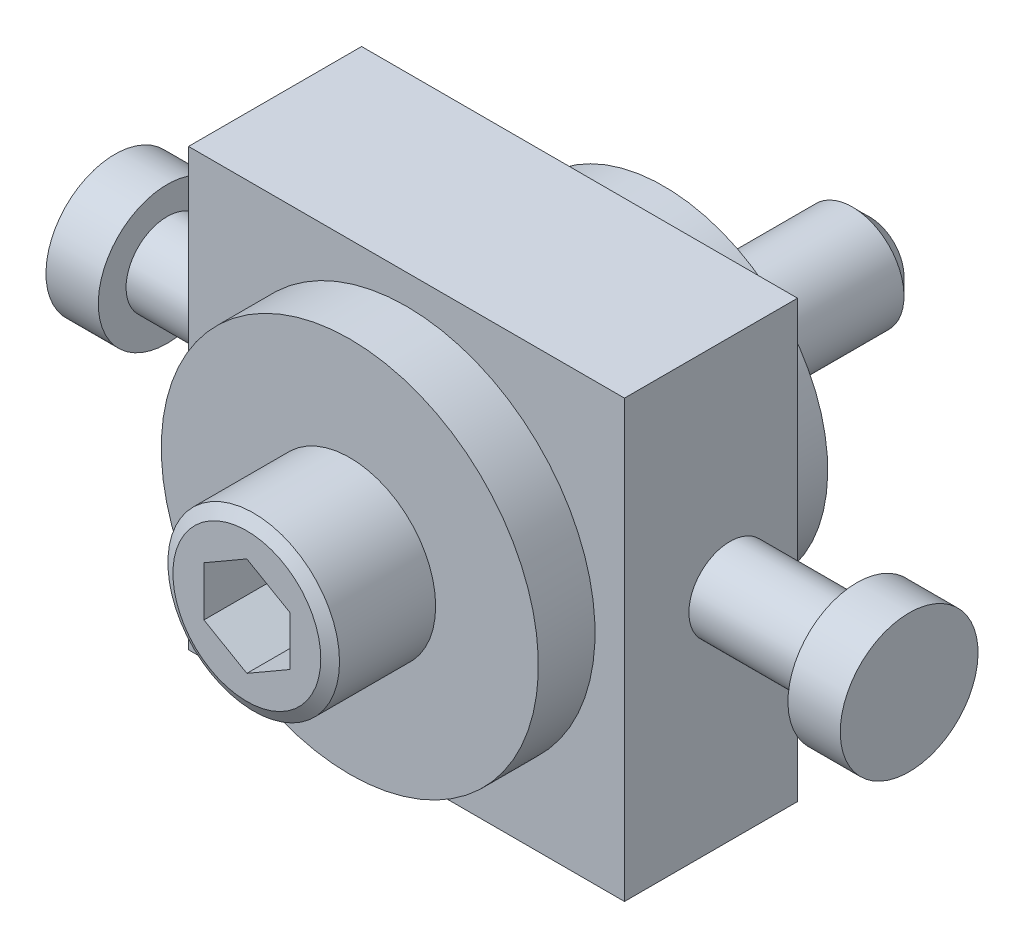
ISO-10303-21;
HEADER;
FILE_DESCRIPTION(('STEP AP214'),'2;1');
FILE_NAME('part.step','',(''),(''),'','','');
FILE_SCHEMA(('AUTOMOTIVE_DESIGN { 1 0 10303 214 1 1 1 1 }'));
ENDSEC;
DATA;
#1=APPLICATION_CONTEXT('core data for automotive mechanical design processes');
#2=APPLICATION_PROTOCOL_DEFINITION('international standard','automotive_design',2000,#1);
#3=PRODUCT_CONTEXT('',#1,'mechanical');
#4=PRODUCT('Part','Part','',(#3));
#5=PRODUCT_RELATED_PRODUCT_CATEGORY('part','',(#4));
#6=PRODUCT_DEFINITION_FORMATION('','',#4);
#7=PRODUCT_DEFINITION_CONTEXT('part definition',#1,'design');
#8=PRODUCT_DEFINITION('design','',#6,#7);
#9=PRODUCT_DEFINITION_SHAPE('','',#8);
#10=(LENGTH_UNIT() NAMED_UNIT(*) SI_UNIT(.MILLI.,.METRE.));
#11=(NAMED_UNIT(*) PLANE_ANGLE_UNIT() SI_UNIT($,.RADIAN.));
#12=(NAMED_UNIT(*) SI_UNIT($,.STERADIAN.) SOLID_ANGLE_UNIT());
#13=UNCERTAINTY_MEASURE_WITH_UNIT(LENGTH_MEASURE(1.E-05),#10,'distance_accuracy_value','');
#14=(GEOMETRIC_REPRESENTATION_CONTEXT(3) GLOBAL_UNCERTAINTY_ASSIGNED_CONTEXT((#13)) GLOBAL_UNIT_ASSIGNED_CONTEXT((#10,
#11,#12)) REPRESENTATION_CONTEXT('',''));
#15=CARTESIAN_POINT('',(0.,0.,0.));
#16=DIRECTION('',(0.,0.,1.));
#17=DIRECTION('',(1.,0.,0.));
#18=AXIS2_PLACEMENT_3D('',#15,#16,#17);
#19=CARTESIAN_POINT('',(20.0914,-4.0613584,4.7778416));
#20=DIRECTION('',(1.,0.,0.));
#21=DIRECTION('',(0.,1.,0.));
#22=AXIS2_PLACEMENT_3D('',#19,#20,#21);
#23=PLANE('',#22);
#24=CARTESIAN_POINT('',(20.0914,0.,8.8392));
#25=DIRECTION('',(1.,0.,0.));
#26=DIRECTION('',(0.,1.,0.));
#27=AXIS2_PLACEMENT_3D('',#24,#25,#26);
#28=CIRCLE('',#27,4.0132);
#29=CARTESIAN_POINT('',(20.0914,4.0132,8.8392));
#30=VERTEX_POINT('',#29);
#31=EDGE_CURVE('E203',#30,#30,#28,.F.);
#32=ORIENTED_EDGE('',*,*,#31,.T.);
#33=EDGE_LOOP('',(#32));
#34=FACE_BOUND('',#33,.T.);
#35=CARTESIAN_POINT('',(20.0914,0.,8.8392));
#36=DIRECTION('',(-1.,0.,0.));
#37=DIRECTION('',(0.,-1.,0.));
#38=AXIS2_PLACEMENT_3D('',#35,#36,#37);
#39=CIRCLE('',#38,2.39395000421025);
#40=CARTESIAN_POINT('',(20.0914,-2.39395000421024,8.8392));
#41=VERTEX_POINT('',#40);
#42=EDGE_CURVE('E96',#41,#41,#39,.T.);
#43=ORIENTED_EDGE('',*,*,#42,.F.);
#44=EDGE_LOOP('',(#43));
#45=FACE_BOUND('',#44,.T.);
#46=ADVANCED_FACE('F14',(#34,#45),#23,.F.);
#47=CARTESIAN_POINT('',(-20.0914,5.567775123,7.4288297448));
#48=DIRECTION('',(-1.,0.,0.));
#49=DIRECTION('',(0.,-0.859090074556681,-0.511824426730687));
#50=AXIS2_PLACEMENT_3D('',#47,#48,#49);
#51=PLANE('',#50);
#52=CARTESIAN_POINT('',(-20.0914,0.,8.8392));
#53=DIRECTION('',(-1.,0.,0.));
#54=DIRECTION('',(0.,-1.,0.));
#55=AXIS2_PLACEMENT_3D('',#52,#53,#54);
#56=CIRCLE('',#55,4.01319999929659);
#57=CARTESIAN_POINT('',(-20.0914,-4.01319999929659,8.8392));
#58=VERTEX_POINT('',#57);
#59=EDGE_CURVE('E200',#58,#58,#56,.F.);
#60=ORIENTED_EDGE('',*,*,#59,.T.);
#61=EDGE_LOOP('',(#60));
#62=FACE_BOUND('',#61,.T.);
#63=CARTESIAN_POINT('',(-20.0914,0.,8.8392));
#64=DIRECTION('',(1.,0.,0.));
#65=DIRECTION('',(0.,1.,0.));
#66=AXIS2_PLACEMENT_3D('',#63,#64,#65);
#67=CIRCLE('',#66,2.3939500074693);
#68=CARTESIAN_POINT('',(-20.0914,2.3939500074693,8.8392));
#69=VERTEX_POINT('',#68);
#70=EDGE_CURVE('E101',#69,#69,#67,.T.);
#71=ORIENTED_EDGE('',*,*,#70,.F.);
#72=EDGE_LOOP('',(#71));
#73=FACE_BOUND('',#72,.T.);
#74=ADVANCED_FACE('F125',(#62,#73),#51,.F.);
#75=CARTESIAN_POINT('',(0.,0.,-11.1575000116));
#76=DIRECTION('',(0.,0.,1.));
#77=DIRECTION('',(1.,0.,0.));
#78=AXIS2_PLACEMENT_3D('',#75,#76,#77);
#79=CYLINDRICAL_SURFACE('',#78,3.0000000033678);
#80=CARTESIAN_POINT('',(0.,0.,-11.));
#81=DIRECTION('',(0.,0.,-1.));
#82=DIRECTION('',(-1.,0.,0.));
#83=AXIS2_PLACEMENT_3D('',#80,#81,#82);
#84=CIRCLE('',#83,3.0000000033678);
#85=CARTESIAN_POINT('',(-3.0000000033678,0.,-11.));
#86=VERTEX_POINT('',#85);
#87=EDGE_CURVE('E9',#86,#86,#84,.F.);
#88=ORIENTED_EDGE('',*,*,#87,.T.);
#89=EDGE_LOOP('',(#88));
#90=FACE_BOUND('',#89,.T.);
#91=CARTESIAN_POINT('',(0.,0.,0.));
#92=DIRECTION('',(0.,0.,-1.));
#93=DIRECTION('',(0.,-1.,0.));
#94=AXIS2_PLACEMENT_3D('',#91,#92,#93);
#95=CIRCLE('',#94,3.0000000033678);
#96=CARTESIAN_POINT('',(0.,-3.0000000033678,0.));
#97=VERTEX_POINT('',#96);
#98=EDGE_CURVE('E107',#97,#97,#95,.T.);
#99=ORIENTED_EDGE('',*,*,#98,.T.);
#100=EDGE_LOOP('',(#99));
#101=FACE_BOUND('',#100,.T.);
#102=ADVANCED_FACE('F131',(#90,#101),#79,.T.);
#103=CARTESIAN_POINT('',(0.,0.,18.288));
#104=DIRECTION('',(0.,0.,1.));
#105=DIRECTION('',(1.,0.,0.));
#106=AXIS2_PLACEMENT_3D('',#103,#104,#105);
#107=CYLINDRICAL_SURFACE('',#106,4.99999999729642);
#108=CARTESIAN_POINT('',(0.,0.,23.8879999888));
#109=DIRECTION('',(0.,0.,1.));
#110=DIRECTION('',(1.,0.,0.));
#111=AXIS2_PLACEMENT_3D('',#108,#109,#110);
#112=CIRCLE('',#111,4.99999999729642);
#113=CARTESIAN_POINT('',(4.99999999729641,0.,23.8879999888));
#114=VERTEX_POINT('',#113);
#115=EDGE_CURVE('E103',#114,#114,#112,.F.);
#116=ORIENTED_EDGE('',*,*,#115,.T.);
#117=EDGE_LOOP('',(#116));
#118=FACE_BOUND('',#117,.T.);
#119=CARTESIAN_POINT('',(0.,0.,18.288));
#120=DIRECTION('',(0.,0.,1.));
#121=DIRECTION('',(1.,0.,0.));
#122=AXIS2_PLACEMENT_3D('',#119,#120,#121);
#123=CIRCLE('',#122,4.99999999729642);
#124=CARTESIAN_POINT('',(4.99999999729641,0.,18.288));
#125=VERTEX_POINT('',#124);
#126=EDGE_CURVE('E187',#125,#125,#123,.F.);
#127=ORIENTED_EDGE('',*,*,#126,.F.);
#128=EDGE_LOOP('',(#127));
#129=FACE_BOUND('',#128,.T.);
#130=ADVANCED_FACE('F179',(#118,#129),#107,.T.);
#131=CARTESIAN_POINT('',(9.3629734,9.3629734,0.));
#132=DIRECTION('',(0.,0.,-1.));
#133=DIRECTION('',(0.,-1.,0.));
#134=AXIS2_PLACEMENT_3D('',#131,#132,#133);
#135=PLANE('',#134);
#136=CARTESIAN_POINT('',(0.,0.,0.));
#137=DIRECTION('',(0.,0.,-1.));
#138=DIRECTION('',(0.,-1.,0.));
#139=AXIS2_PLACEMENT_3D('',#136,#137,#138);
#140=CIRCLE('',#139,9.55675);
#141=CARTESIAN_POINT('',(0.,-9.55675,0.));
#142=VERTEX_POINT('',#141);
#143=EDGE_CURVE('E106',#142,#142,#140,.T.);
#144=ORIENTED_EDGE('',*,*,#143,.T.);
#145=EDGE_LOOP('',(#144));
#146=FACE_BOUND('',#145,.T.);
#147=ORIENTED_EDGE('',*,*,#98,.F.);
#148=EDGE_LOOP('',(#147));
#149=FACE_BOUND('',#148,.T.);
#150=ADVANCED_FACE('F182',(#146,#149),#135,.T.);
#151=CARTESIAN_POINT('',(8.5071319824,4.092723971,18.288));
#152=DIRECTION('',(0.,0.,1.));
#153=DIRECTION('',(0.,1.,0.));
#154=AXIS2_PLACEMENT_3D('',#151,#152,#153);
#155=PLANE('',#154);
#156=ORIENTED_EDGE('',*,*,#126,.T.);
#157=EDGE_LOOP('',(#156));
#158=FACE_BOUND('',#157,.T.);
#159=CARTESIAN_POINT('',(0.,0.,18.288));
#160=DIRECTION('',(0.,0.,1.));
#161=DIRECTION('',(0.,1.,0.));
#162=AXIS2_PLACEMENT_3D('',#159,#160,#161);
#163=CIRCLE('',#162,10.9855);
#164=CARTESIAN_POINT('',(0.,10.9855,18.288));
#165=VERTEX_POINT('',#164);
#166=EDGE_CURVE('E189',#165,#165,#163,.T.);
#167=ORIENTED_EDGE('',*,*,#166,.T.);
#168=EDGE_LOOP('',(#167));
#169=FACE_BOUND('',#168,.T.);
#170=ADVANCED_FACE('F184',(#158,#169),#155,.T.);
#171=CARTESIAN_POINT('',(0.,0.,4.2164));
#172=DIRECTION('',(0.,0.,-1.));
#173=DIRECTION('',(0.,-1.,0.));
#174=AXIS2_PLACEMENT_3D('',#171,#172,#173);
#175=CYLINDRICAL_SURFACE('',#174,9.55675);
#176=ORIENTED_EDGE('',*,*,#143,.F.);
#177=EDGE_LOOP('',(#176));
#178=FACE_BOUND('',#177,.T.);
#179=CARTESIAN_POINT('',(0.,0.,4.9022));
#180=DIRECTION('',(0.,0.,-1.));
#181=DIRECTION('',(0.,-1.,0.));
#182=AXIS2_PLACEMENT_3D('',#179,#180,#181);
#183=CIRCLE('',#182,9.55675);
#184=CARTESIAN_POINT('',(0.,-9.55675,4.9022));
#185=VERTEX_POINT('',#184);
#186=EDGE_CURVE('E192',#185,#185,#183,.T.);
#187=ORIENTED_EDGE('',*,*,#186,.T.);
#188=EDGE_LOOP('',(#187));
#189=FACE_BOUND('',#188,.T.);
#190=ADVANCED_FACE('F235',(#178,#189),#175,.T.);
#191=CARTESIAN_POINT('',(0.,0.,17.526));
#192=DIRECTION('',(0.,0.,-1.));
#193=DIRECTION('',(-1.,0.,0.));
#194=AXIS2_PLACEMENT_3D('',#191,#192,#193);
#195=CYLINDRICAL_SURFACE('',#194,10.9855);
#196=ORIENTED_EDGE('',*,*,#166,.F.);
#197=EDGE_LOOP('',(#196));
#198=FACE_BOUND('',#197,.T.);
#199=CARTESIAN_POINT('',(0.,0.,14.986));
#200=DIRECTION('',(0.,0.,1.));
#201=DIRECTION('',(0.,1.,0.));
#202=AXIS2_PLACEMENT_3D('',#199,#200,#201);
#203=CIRCLE('',#202,10.9855);
#204=CARTESIAN_POINT('',(0.,10.9855,14.986));
#205=VERTEX_POINT('',#204);
#206=EDGE_CURVE('E209',#205,#205,#203,.T.);
#207=ORIENTED_EDGE('',*,*,#206,.T.);
#208=EDGE_LOOP('',(#207));
#209=FACE_BOUND('',#208,.T.);
#210=ADVANCED_FACE('F161',(#198,#209),#195,.T.);
#211=CARTESIAN_POINT('',(12.7,12.7,4.9022));
#212=DIRECTION('',(0.,0.,-1.));
#213=DIRECTION('',(0.,-1.,0.));
#214=AXIS2_PLACEMENT_3D('',#211,#212,#213);
#215=PLANE('',#214);
#216=DIRECTION('',(0.,1.,0.));
#217=VECTOR('',#216,1.);
#218=CARTESIAN_POINT('',(-12.7,0.,4.9022));
#219=LINE('',#218,#217);
#220=CARTESIAN_POINT('',(-12.7,-12.7,4.9022));
#221=VERTEX_POINT('',#220);
#222=CARTESIAN_POINT('',(-12.7,12.7,4.9022));
#223=VERTEX_POINT('',#222);
#224=EDGE_CURVE('E205',#221,#223,#219,.T.);
#225=ORIENTED_EDGE('',*,*,#224,.T.);
#226=DIRECTION('',(1.,0.,0.));
#227=VECTOR('',#226,1.);
#228=CARTESIAN_POINT('',(0.,12.7,4.9022));
#229=LINE('',#228,#227);
#230=CARTESIAN_POINT('',(12.7,12.7,4.9022));
#231=VERTEX_POINT('',#230);
#232=EDGE_CURVE('E208',#223,#231,#229,.T.);
#233=ORIENTED_EDGE('',*,*,#232,.T.);
#234=DIRECTION('',(0.,-1.,0.));
#235=VECTOR('',#234,1.);
#236=CARTESIAN_POINT('',(12.7,0.,4.9022));
#237=LINE('',#236,#235);
#238=CARTESIAN_POINT('',(12.7,-12.7,4.9022));
#239=VERTEX_POINT('',#238);
#240=EDGE_CURVE('E71',#231,#239,#237,.T.);
#241=ORIENTED_EDGE('',*,*,#240,.T.);
#242=DIRECTION('',(-1.,0.,0.));
#243=VECTOR('',#242,1.);
#244=CARTESIAN_POINT('',(0.,-12.7,4.9022));
#245=LINE('',#244,#243);
#246=EDGE_CURVE('E214',#239,#221,#245,.T.);
#247=ORIENTED_EDGE('',*,*,#246,.T.);
#248=EDGE_LOOP('',(#225,#233,#241,#247));
#249=FACE_BOUND('',#248,.T.);
#250=ORIENTED_EDGE('',*,*,#186,.F.);
#251=EDGE_LOOP('',(#250));
#252=FACE_BOUND('',#251,.T.);
#253=ADVANCED_FACE('F134',(#249,#252),#215,.T.);
#254=CARTESIAN_POINT('',(12.7,-12.7,4.9022));
#255=DIRECTION('',(0.,1.,0.));
#256=DIRECTION('',(-1.,0.,0.));
#257=AXIS2_PLACEMENT_3D('',#254,#255,#256);
#258=PLANE('',#257);
#259=DIRECTION('',(0.,0.,-1.));
#260=VECTOR('',#259,1.);
#261=CARTESIAN_POINT('',(12.7,-12.7,9.9441));
#262=LINE('',#261,#260);
#263=CARTESIAN_POINT('',(12.7,-12.7,14.986));
#264=VERTEX_POINT('',#263);
#265=EDGE_CURVE('E84',#264,#239,#262,.T.);
#266=ORIENTED_EDGE('',*,*,#265,.F.);
#267=DIRECTION('',(1.,0.,0.));
#268=VECTOR('',#267,1.);
#269=CARTESIAN_POINT('',(0.,-12.7,14.986));
#270=LINE('',#269,#268);
#271=CARTESIAN_POINT('',(-12.7,-12.7,14.986));
#272=VERTEX_POINT('',#271);
#273=EDGE_CURVE('E83',#272,#264,#270,.T.);
#274=ORIENTED_EDGE('',*,*,#273,.F.);
#275=DIRECTION('',(0.,0.,-1.));
#276=VECTOR('',#275,1.);
#277=CARTESIAN_POINT('',(-12.7,-12.7,9.9441));
#278=LINE('',#277,#276);
#279=EDGE_CURVE('E210',#272,#221,#278,.T.);
#280=ORIENTED_EDGE('',*,*,#279,.T.);
#281=ORIENTED_EDGE('',*,*,#246,.F.);
#282=EDGE_LOOP('',(#266,#274,#280,#281));
#283=FACE_BOUND('',#282,.T.);
#284=ADVANCED_FACE('F149',(#283),#258,.F.);
#285=CARTESIAN_POINT('',(12.7,12.7,14.986));
#286=DIRECTION('',(0.,0.,-1.));
#287=DIRECTION('',(0.,-1.,0.));
#288=AXIS2_PLACEMENT_3D('',#285,#286,#287);
#289=PLANE('',#288);
#290=ORIENTED_EDGE('',*,*,#206,.F.);
#291=EDGE_LOOP('',(#290));
#292=FACE_BOUND('',#291,.T.);
#293=DIRECTION('',(1.,0.,0.));
#294=VECTOR('',#293,1.);
#295=CARTESIAN_POINT('',(0.,12.7,14.986));
#296=LINE('',#295,#294);
#297=CARTESIAN_POINT('',(-12.7,12.7,14.986));
#298=VERTEX_POINT('',#297);
#299=CARTESIAN_POINT('',(12.7,12.7,14.986));
#300=VERTEX_POINT('',#299);
#301=EDGE_CURVE('E76',#298,#300,#296,.T.);
#302=ORIENTED_EDGE('',*,*,#301,.F.);
#303=DIRECTION('',(0.,-1.,0.));
#304=VECTOR('',#303,1.);
#305=CARTESIAN_POINT('',(-12.7,0.,14.986));
#306=LINE('',#305,#304);
#307=EDGE_CURVE('E213',#298,#272,#306,.T.);
#308=ORIENTED_EDGE('',*,*,#307,.T.);
#309=ORIENTED_EDGE('',*,*,#273,.T.);
#310=DIRECTION('',(0.,-1.,0.));
#311=VECTOR('',#310,1.);
#312=CARTESIAN_POINT('',(12.7,0.,14.986));
#313=LINE('',#312,#311);
#314=EDGE_CURVE('E69',#300,#264,#313,.T.);
#315=ORIENTED_EDGE('',*,*,#314,.F.);
#316=EDGE_LOOP('',(#302,#308,#309,#315));
#317=FACE_BOUND('',#316,.T.);
#318=ADVANCED_FACE('F80',(#292,#317),#289,.F.);
#319=CARTESIAN_POINT('',(-12.7,12.7,4.9022));
#320=DIRECTION('',(0.,-1.,0.));
#321=DIRECTION('',(1.,0.,0.));
#322=AXIS2_PLACEMENT_3D('',#319,#320,#321);
#323=PLANE('',#322);
#324=DIRECTION('',(0.,0.,1.));
#325=VECTOR('',#324,1.);
#326=CARTESIAN_POINT('',(-12.7,12.7,9.9441));
#327=LINE('',#326,#325);
#328=EDGE_CURVE('E88',#223,#298,#327,.T.);
#329=ORIENTED_EDGE('',*,*,#328,.T.);
#330=ORIENTED_EDGE('',*,*,#301,.T.);
#331=DIRECTION('',(0.,0.,1.));
#332=VECTOR('',#331,1.);
#333=CARTESIAN_POINT('',(12.7,12.7,9.9441));
#334=LINE('',#333,#332);
#335=EDGE_CURVE('E64',#231,#300,#334,.T.);
#336=ORIENTED_EDGE('',*,*,#335,.F.);
#337=ORIENTED_EDGE('',*,*,#232,.F.);
#338=EDGE_LOOP('',(#329,#330,#336,#337));
#339=FACE_BOUND('',#338,.T.);
#340=ADVANCED_FACE('F87',(#339),#323,.F.);
#341=CARTESIAN_POINT('',(12.7,12.7,4.9022));
#342=DIRECTION('',(-1.,0.,0.));
#343=DIRECTION('',(0.,-1.,0.));
#344=AXIS2_PLACEMENT_3D('',#341,#342,#343);
#345=PLANE('',#344);
#346=ORIENTED_EDGE('',*,*,#335,.T.);
#347=ORIENTED_EDGE('',*,*,#314,.T.);
#348=ORIENTED_EDGE('',*,*,#265,.T.);
#349=ORIENTED_EDGE('',*,*,#240,.F.);
#350=EDGE_LOOP('',(#346,#347,#348,#349));
#351=FACE_BOUND('',#350,.T.);
#352=CARTESIAN_POINT('',(12.7,0.,8.8392));
#353=DIRECTION('',(-1.,0.,0.));
#354=DIRECTION('',(0.,-1.,0.));
#355=AXIS2_PLACEMENT_3D('',#352,#353,#354);
#356=CIRCLE('',#355,2.39395);
#357=CARTESIAN_POINT('',(12.7,-2.39395,8.8392));
#358=VERTEX_POINT('',#357);
#359=EDGE_CURVE('E93',#358,#358,#356,.F.);
#360=ORIENTED_EDGE('',*,*,#359,.F.);
#361=EDGE_LOOP('',(#360));
#362=FACE_BOUND('',#361,.T.);
#363=ADVANCED_FACE('F66',(#351,#362),#345,.F.);
#364=CARTESIAN_POINT('',(23.1394,3.5472624,5.2919376));
#365=DIRECTION('',(-1.,0.,0.));
#366=DIRECTION('',(0.,-1.,0.));
#367=AXIS2_PLACEMENT_3D('',#364,#365,#366);
#368=PLANE('',#367);
#369=CARTESIAN_POINT('',(23.1394,0.,8.8392));
#370=DIRECTION('',(1.,0.,0.));
#371=DIRECTION('',(0.,1.,0.));
#372=AXIS2_PLACEMENT_3D('',#369,#370,#371);
#373=CIRCLE('',#372,4.0132);
#374=CARTESIAN_POINT('',(23.1394,4.0132,8.8392));
#375=VERTEX_POINT('',#374);
#376=EDGE_CURVE('E97',#375,#375,#373,.T.);
#377=ORIENTED_EDGE('',*,*,#376,.T.);
#378=EDGE_LOOP('',(#377));
#379=FACE_BOUND('',#378,.T.);
#380=ADVANCED_FACE('F141',(#379),#368,.F.);
#381=CARTESIAN_POINT('',(9.1059,0.,8.8392));
#382=DIRECTION('',(1.,0.,0.));
#383=DIRECTION('',(0.,0.,-1.));
#384=AXIS2_PLACEMENT_3D('',#381,#382,#383);
#385=CYLINDRICAL_SURFACE('',#384,2.39395);
#386=ORIENTED_EDGE('',*,*,#359,.T.);
#387=EDGE_LOOP('',(#386));
#388=FACE_BOUND('',#387,.T.);
#389=ORIENTED_EDGE('',*,*,#42,.T.);
#390=EDGE_LOOP('',(#389));
#391=FACE_BOUND('',#390,.T.);
#392=ADVANCED_FACE('F139',(#388,#391),#385,.T.);
#393=CARTESIAN_POINT('',(20.0914,0.,8.8392));
#394=DIRECTION('',(1.,0.,0.));
#395=DIRECTION('',(0.,1.,0.));
#396=AXIS2_PLACEMENT_3D('',#393,#394,#395);
#397=CYLINDRICAL_SURFACE('',#396,4.0132);
#398=ORIENTED_EDGE('',*,*,#31,.F.);
#399=EDGE_LOOP('',(#398));
#400=FACE_BOUND('',#399,.T.);
#401=ORIENTED_EDGE('',*,*,#376,.F.);
#402=EDGE_LOOP('',(#401));
#403=FACE_BOUND('',#402,.T.);
#404=ADVANCED_FACE('F145',(#400,#403),#397,.T.);
#405=CARTESIAN_POINT('',(-12.7,-12.7,4.9022));
#406=DIRECTION('',(1.,0.,0.));
#407=DIRECTION('',(0.,1.,0.));
#408=AXIS2_PLACEMENT_3D('',#405,#406,#407);
#409=PLANE('',#408);
#410=ORIENTED_EDGE('',*,*,#279,.F.);
#411=ORIENTED_EDGE('',*,*,#307,.F.);
#412=ORIENTED_EDGE('',*,*,#328,.F.);
#413=ORIENTED_EDGE('',*,*,#224,.F.);
#414=EDGE_LOOP('',(#410,#411,#412,#413));
#415=FACE_BOUND('',#414,.T.);
#416=CARTESIAN_POINT('',(-12.7,0.,8.8392));
#417=DIRECTION('',(1.,0.,0.));
#418=DIRECTION('',(0.,1.,0.));
#419=AXIS2_PLACEMENT_3D('',#416,#417,#418);
#420=CIRCLE('',#419,2.39395000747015);
#421=CARTESIAN_POINT('',(-12.7,2.39395000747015,8.8392));
#422=VERTEX_POINT('',#421);
#423=EDGE_CURVE('E98',#422,#422,#420,.F.);
#424=ORIENTED_EDGE('',*,*,#423,.F.);
#425=EDGE_LOOP('',(#424));
#426=FACE_BOUND('',#425,.T.);
#427=ADVANCED_FACE('F150',(#415,#426),#409,.F.);
#428=CARTESIAN_POINT('',(-23.1394,-1.2318423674,3.9762065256));
#429=DIRECTION('',(1.,0.,0.));
#430=DIRECTION('',(0.,0.859090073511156,0.511824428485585));
#431=AXIS2_PLACEMENT_3D('',#428,#429,#430);
#432=PLANE('',#431);
#433=CARTESIAN_POINT('',(-23.1394,0.,8.8392));
#434=DIRECTION('',(-1.,0.,0.));
#435=DIRECTION('',(0.,-1.,0.));
#436=AXIS2_PLACEMENT_3D('',#433,#434,#435);
#437=CIRCLE('',#436,4.01319999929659);
#438=CARTESIAN_POINT('',(-23.1394,-4.01319999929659,8.8392));
#439=VERTEX_POINT('',#438);
#440=EDGE_CURVE('E102',#439,#439,#437,.T.);
#441=ORIENTED_EDGE('',*,*,#440,.T.);
#442=EDGE_LOOP('',(#441));
#443=FACE_BOUND('',#442,.T.);
#444=ADVANCED_FACE('F164',(#443),#432,.F.);
#445=CARTESIAN_POINT('',(-20.0914,0.,8.8392));
#446=DIRECTION('',(-1.,0.,0.));
#447=DIRECTION('',(0.,-1.,0.));
#448=AXIS2_PLACEMENT_3D('',#445,#446,#447);
#449=CYLINDRICAL_SURFACE('',#448,4.01319999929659);
#450=ORIENTED_EDGE('',*,*,#440,.F.);
#451=EDGE_LOOP('',(#450));
#452=FACE_BOUND('',#451,.T.);
#453=ORIENTED_EDGE('',*,*,#59,.F.);
#454=EDGE_LOOP('',(#453));
#455=FACE_BOUND('',#454,.T.);
#456=ADVANCED_FACE('F146',(#452,#455),#449,.T.);
#457=CARTESIAN_POINT('',(-9.1059,0.,8.8392));
#458=DIRECTION('',(-1.,0.,0.));
#459=DIRECTION('',(0.,0.,1.));
#460=AXIS2_PLACEMENT_3D('',#457,#458,#459);
#461=CYLINDRICAL_SURFACE('',#460,2.39395000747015);
#462=ORIENTED_EDGE('',*,*,#423,.T.);
#463=EDGE_LOOP('',(#462));
#464=FACE_BOUND('',#463,.T.);
#465=ORIENTED_EDGE('',*,*,#70,.T.);
#466=EDGE_LOOP('',(#465));
#467=FACE_BOUND('',#466,.T.);
#468=ADVANCED_FACE('F255',(#464,#467),#461,.T.);
#469=CARTESIAN_POINT('',(0.,2.88675134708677,20.2879999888));
#470=DIRECTION('',(0.,0.,1.));
#471=DIRECTION('',(1.,0.,0.));
#472=AXIS2_PLACEMENT_3D('',#469,#470,#471);
#473=PLANE('',#472);
#474=DIRECTION('',(-0.866025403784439,0.5,0.));
#475=VECTOR('',#474,1.);
#476=CARTESIAN_POINT('',(2.5,1.4433756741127,20.2879999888));
#477=LINE('',#476,#475);
#478=CARTESIAN_POINT('',(2.5,1.4433756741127,20.2879999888));
#479=VERTEX_POINT('',#478);
#480=CARTESIAN_POINT('',(0.,2.88675134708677,20.2879999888));
#481=VERTEX_POINT('',#480);
#482=EDGE_CURVE('E228',#479,#481,#477,.T.);
#483=ORIENTED_EDGE('',*,*,#482,.T.);
#484=DIRECTION('',(-0.866025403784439,-0.5,0.));
#485=VECTOR('',#484,1.);
#486=CARTESIAN_POINT('',(0.,2.88675134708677,20.2879999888));
#487=LINE('',#486,#485);
#488=CARTESIAN_POINT('',(-2.5,1.4433756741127,20.2879999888));
#489=VERTEX_POINT('',#488);
#490=EDGE_CURVE('E508',#481,#489,#487,.T.);
#491=ORIENTED_EDGE('',*,*,#490,.T.);
#492=DIRECTION('',(0.,-1.,0.));
#493=VECTOR('',#492,1.);
#494=CARTESIAN_POINT('',(-2.5,1.4433756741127,20.2879999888));
#495=LINE('',#494,#493);
#496=CARTESIAN_POINT('',(-2.5,-1.44337567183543,20.2879999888));
#497=VERTEX_POINT('',#496);
#498=EDGE_CURVE('E543',#489,#497,#495,.T.);
#499=ORIENTED_EDGE('',*,*,#498,.T.);
#500=DIRECTION('',(0.866025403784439,-0.5,0.));
#501=VECTOR('',#500,1.);
#502=CARTESIAN_POINT('',(-2.5,-1.44337567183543,20.2879999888));
#503=LINE('',#502,#501);
#504=CARTESIAN_POINT('',(0.,-2.88675134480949,20.2879999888));
#505=VERTEX_POINT('',#504);
#506=EDGE_CURVE('E564',#497,#505,#503,.T.);
#507=ORIENTED_EDGE('',*,*,#506,.T.);
#508=DIRECTION('',(0.866025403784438,0.5,0.));
#509=VECTOR('',#508,1.);
#510=CARTESIAN_POINT('',(0.,-2.88675134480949,20.2879999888));
#511=LINE('',#510,#509);
#512=CARTESIAN_POINT('',(2.5,-1.44337567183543,20.2879999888));
#513=VERTEX_POINT('',#512);
#514=EDGE_CURVE('E516',#505,#513,#511,.T.);
#515=ORIENTED_EDGE('',*,*,#514,.T.);
#516=DIRECTION('',(0.,1.,0.));
#517=VECTOR('',#516,1.);
#518=CARTESIAN_POINT('',(2.5,-1.44337567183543,20.2879999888));
#519=LINE('',#518,#517);
#520=EDGE_CURVE('E513',#513,#479,#519,.T.);
#521=ORIENTED_EDGE('',*,*,#520,.T.);
#522=EDGE_LOOP('',(#483,#491,#499,#507,#515,#521));
#523=FACE_BOUND('',#522,.T.);
#524=ADVANCED_FACE('F260',(#523),#473,.T.);
#525=CARTESIAN_POINT('',(0.,2.88675134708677,20.2879999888));
#526=DIRECTION('',(-0.5,0.866025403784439,0.));
#527=DIRECTION('',(-0.866025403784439,-0.5,0.));
#528=AXIS2_PLACEMENT_3D('',#525,#526,#527);
#529=PLANE('',#528);
#530=DIRECTION('',(-0.866025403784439,-0.5,0.));
#531=VECTOR('',#530,1.);
#532=CARTESIAN_POINT('',(0.,2.88675134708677,24.2879999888));
#533=LINE('',#532,#531);
#534=CARTESIAN_POINT('',(0.,2.88675134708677,24.2879999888));
#535=VERTEX_POINT('',#534);
#536=CARTESIAN_POINT('',(-2.5,1.4433756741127,24.2879999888));
#537=VERTEX_POINT('',#536);
#538=EDGE_CURVE('E505',#535,#537,#533,.T.);
#539=ORIENTED_EDGE('',*,*,#538,.T.);
#540=DIRECTION('',(0.,0.,1.));
#541=VECTOR('',#540,1.);
#542=CARTESIAN_POINT('',(-2.5,1.4433756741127,20.2879999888));
#543=LINE('',#542,#541);
#544=EDGE_CURVE('E520',#489,#537,#543,.T.);
#545=ORIENTED_EDGE('',*,*,#544,.F.);
#546=ORIENTED_EDGE('',*,*,#490,.F.);
#547=DIRECTION('',(0.,0.,1.));
#548=VECTOR('',#547,1.);
#549=CARTESIAN_POINT('',(0.,2.88675134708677,20.2879999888));
#550=LINE('',#549,#548);
#551=EDGE_CURVE('E495',#481,#535,#550,.T.);
#552=ORIENTED_EDGE('',*,*,#551,.T.);
#553=EDGE_LOOP('',(#539,#545,#546,#552));
#554=FACE_BOUND('',#553,.T.);
#555=ADVANCED_FACE('F267',(#554),#529,.F.);
#556=CARTESIAN_POINT('',(-2.5,1.4433756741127,20.2879999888));
#557=DIRECTION('',(-1.,0.,0.));
#558=DIRECTION('',(0.,-1.,0.));
#559=AXIS2_PLACEMENT_3D('',#556,#557,#558);
#560=PLANE('',#559);
#561=DIRECTION('',(0.,-1.,0.));
#562=VECTOR('',#561,1.);
#563=CARTESIAN_POINT('',(-2.5,1.4433756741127,24.2879999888));
#564=LINE('',#563,#562);
#565=CARTESIAN_POINT('',(-2.5,-1.44337567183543,24.2879999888));
#566=VERTEX_POINT('',#565);
#567=EDGE_CURVE('E510',#537,#566,#564,.T.);
#568=ORIENTED_EDGE('',*,*,#567,.T.);
#569=DIRECTION('',(0.,0.,1.));
#570=VECTOR('',#569,1.);
#571=CARTESIAN_POINT('',(-2.5,-1.44337567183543,20.2879999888));
#572=LINE('',#571,#570);
#573=EDGE_CURVE('E524',#497,#566,#572,.T.);
#574=ORIENTED_EDGE('',*,*,#573,.F.);
#575=ORIENTED_EDGE('',*,*,#498,.F.);
#576=ORIENTED_EDGE('',*,*,#544,.T.);
#577=EDGE_LOOP('',(#568,#574,#575,#576));
#578=FACE_BOUND('',#577,.T.);
#579=ADVANCED_FACE('F331',(#578),#560,.F.);
#580=CARTESIAN_POINT('',(-2.5,-1.44337567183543,20.2879999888));
#581=DIRECTION('',(-0.5,-0.866025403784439,0.));
#582=DIRECTION('',(0.866025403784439,-0.5,0.));
#583=AXIS2_PLACEMENT_3D('',#580,#581,#582);
#584=PLANE('',#583);
#585=DIRECTION('',(0.866025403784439,-0.5,0.));
#586=VECTOR('',#585,1.);
#587=CARTESIAN_POINT('',(-2.5,-1.44337567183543,24.2879999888));
#588=LINE('',#587,#586);
#589=CARTESIAN_POINT('',(0.,-2.88675134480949,24.2879999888));
#590=VERTEX_POINT('',#589);
#591=EDGE_CURVE('E521',#566,#590,#588,.T.);
#592=ORIENTED_EDGE('',*,*,#591,.T.);
#593=DIRECTION('',(0.,0.,1.));
#594=VECTOR('',#593,1.);
#595=CARTESIAN_POINT('',(0.,-2.88675134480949,20.2879999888));
#596=LINE('',#595,#594);
#597=EDGE_CURVE('E528',#505,#590,#596,.T.);
#598=ORIENTED_EDGE('',*,*,#597,.F.);
#599=ORIENTED_EDGE('',*,*,#506,.F.);
#600=ORIENTED_EDGE('',*,*,#573,.T.);
#601=EDGE_LOOP('',(#592,#598,#599,#600));
#602=FACE_BOUND('',#601,.T.);
#603=ADVANCED_FACE('F341',(#602),#584,.F.);
#604=CARTESIAN_POINT('',(0.,-2.88675134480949,20.2879999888));
#605=DIRECTION('',(0.5,-0.866025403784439,0.));
#606=DIRECTION('',(0.866025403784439,0.5,0.));
#607=AXIS2_PLACEMENT_3D('',#604,#605,#606);
#608=PLANE('',#607);
#609=DIRECTION('',(0.866025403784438,0.5,0.));
#610=VECTOR('',#609,1.);
#611=CARTESIAN_POINT('',(0.,-2.88675134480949,24.2879999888));
#612=LINE('',#611,#610);
#613=CARTESIAN_POINT('',(2.5,-1.44337567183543,24.2879999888));
#614=VERTEX_POINT('',#613);
#615=EDGE_CURVE('E525',#590,#614,#612,.T.);
#616=ORIENTED_EDGE('',*,*,#615,.T.);
#617=DIRECTION('',(0.,0.,1.));
#618=VECTOR('',#617,1.);
#619=CARTESIAN_POINT('',(2.5,-1.44337567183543,20.2879999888));
#620=LINE('',#619,#618);
#621=EDGE_CURVE('E500',#513,#614,#620,.T.);
#622=ORIENTED_EDGE('',*,*,#621,.F.);
#623=ORIENTED_EDGE('',*,*,#514,.F.);
#624=ORIENTED_EDGE('',*,*,#597,.T.);
#625=EDGE_LOOP('',(#616,#622,#623,#624));
#626=FACE_BOUND('',#625,.T.);
#627=ADVANCED_FACE('F351',(#626),#608,.F.);
#628=CARTESIAN_POINT('',(2.5,-1.44337567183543,20.2879999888));
#629=DIRECTION('',(1.,0.,0.));
#630=DIRECTION('',(0.,0.,-1.));
#631=AXIS2_PLACEMENT_3D('',#628,#629,#630);
#632=PLANE('',#631);
#633=DIRECTION('',(0.,1.,0.));
#634=VECTOR('',#633,1.);
#635=CARTESIAN_POINT('',(2.5,-1.44337567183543,24.2879999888));
#636=LINE('',#635,#634);
#637=CARTESIAN_POINT('',(2.5,1.4433756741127,24.2879999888));
#638=VERTEX_POINT('',#637);
#639=EDGE_CURVE('E529',#614,#638,#636,.T.);
#640=ORIENTED_EDGE('',*,*,#639,.T.);
#641=DIRECTION('',(0.,0.,1.));
#642=VECTOR('',#641,1.);
#643=CARTESIAN_POINT('',(2.5,1.4433756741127,20.2879999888));
#644=LINE('',#643,#642);
#645=EDGE_CURVE('E31',#479,#638,#644,.T.);
#646=ORIENTED_EDGE('',*,*,#645,.F.);
#647=ORIENTED_EDGE('',*,*,#520,.F.);
#648=ORIENTED_EDGE('',*,*,#621,.T.);
#649=EDGE_LOOP('',(#640,#646,#647,#648));
#650=FACE_BOUND('',#649,.T.);
#651=ADVANCED_FACE('F361',(#650),#632,.F.);
#652=CARTESIAN_POINT('',(2.5,1.4433756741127,20.2879999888));
#653=DIRECTION('',(0.5,0.866025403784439,0.));
#654=DIRECTION('',(-0.866025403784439,0.5,0.));
#655=AXIS2_PLACEMENT_3D('',#652,#653,#654);
#656=PLANE('',#655);
#657=DIRECTION('',(-0.866025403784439,0.5,0.));
#658=VECTOR('',#657,1.);
#659=CARTESIAN_POINT('',(2.5,1.4433756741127,24.2879999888));
#660=LINE('',#659,#658);
#661=EDGE_CURVE('E493',#638,#535,#660,.T.);
#662=ORIENTED_EDGE('',*,*,#661,.T.);
#663=ORIENTED_EDGE('',*,*,#551,.F.);
#664=ORIENTED_EDGE('',*,*,#482,.F.);
#665=ORIENTED_EDGE('',*,*,#645,.T.);
#666=EDGE_LOOP('',(#662,#663,#664,#665));
#667=FACE_BOUND('',#666,.T.);
#668=ADVANCED_FACE('F172',(#667),#656,.F.);
#669=CARTESIAN_POINT('',(3.5391443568,-5.2085806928,24.2879999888));
#670=DIRECTION('',(0.,0.,1.));
#671=DIRECTION('',(0.187459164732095,0.98227239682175,0.));
#672=AXIS2_PLACEMENT_3D('',#669,#670,#671);
#673=PLANE('',#672);
#674=CARTESIAN_POINT('',(0.,0.,24.2879999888));
#675=DIRECTION('',(0.,0.,1.));
#676=DIRECTION('',(1.,0.,0.));
#677=AXIS2_PLACEMENT_3D('',#674,#675,#676);
#678=CIRCLE('',#677,4.30717967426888);
#679=CARTESIAN_POINT('',(4.30717967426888,0.,24.2879999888));
#680=VERTEX_POINT('',#679);
#681=EDGE_CURVE('E108',#680,#680,#678,.T.);
#682=ORIENTED_EDGE('',*,*,#681,.T.);
#683=EDGE_LOOP('',(#682));
#684=FACE_BOUND('',#683,.T.);
#685=ORIENTED_EDGE('',*,*,#661,.F.);
#686=ORIENTED_EDGE('',*,*,#639,.F.);
#687=ORIENTED_EDGE('',*,*,#615,.F.);
#688=ORIENTED_EDGE('',*,*,#591,.F.);
#689=ORIENTED_EDGE('',*,*,#567,.F.);
#690=ORIENTED_EDGE('',*,*,#538,.F.);
#691=EDGE_LOOP('',(#685,#686,#687,#688,#689,#690));
#692=FACE_BOUND('',#691,.T.);
#693=ADVANCED_FACE('F167',(#684,#692),#673,.T.);
#694=CARTESIAN_POINT('',(0.,0.,23.8879999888));
#695=DIRECTION('',(0.,0.,-1.));
#696=DIRECTION('',(-1.,0.,0.));
#697=AXIS2_PLACEMENT_3D('',#694,#695,#696);
#698=CONICAL_SURFACE('',#697,4.99999999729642,1.0471975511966);
#699=ORIENTED_EDGE('',*,*,#681,.F.);
#700=EDGE_LOOP('',(#699));
#701=FACE_BOUND('',#700,.T.);
#702=ORIENTED_EDGE('',*,*,#115,.F.);
#703=EDGE_LOOP('',(#702));
#704=FACE_BOUND('',#703,.T.);
#705=ADVANCED_FACE('F121',(#701,#704),#698,.T.);
#706=CARTESIAN_POINT('',(0.,0.,-12.));
#707=DIRECTION('',(0.,0.,-1.));
#708=DIRECTION('',(-1.,0.,0.));
#709=AXIS2_PLACEMENT_3D('',#706,#707,#708);
#710=PLANE('',#709);
#711=CARTESIAN_POINT('',(0.,0.,-12.));
#712=DIRECTION('',(0.,0.,-1.));
#713=DIRECTION('',(-1.,0.,0.));
#714=AXIS2_PLACEMENT_3D('',#711,#712,#713);
#715=CIRCLE('',#714,2.00000000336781);
#716=CARTESIAN_POINT('',(-2.00000000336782,0.,-12.));
#717=VERTEX_POINT('',#716);
#718=EDGE_CURVE('E23',#717,#717,#715,.T.);
#719=ORIENTED_EDGE('',*,*,#718,.T.);
#720=EDGE_LOOP('',(#719));
#721=FACE_BOUND('',#720,.T.);
#722=ADVANCED_FACE('F113',(#721),#710,.T.);
#723=CARTESIAN_POINT('',(0.,0.,-12.));
#724=DIRECTION('',(0.,0.,1.));
#725=DIRECTION('',(1.,0.,0.));
#726=AXIS2_PLACEMENT_3D('',#723,#724,#725);
#727=CONICAL_SURFACE('',#726,2.00000000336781,0.785398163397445);
#728=ORIENTED_EDGE('',*,*,#87,.F.);
#729=EDGE_LOOP('',(#728));
#730=FACE_BOUND('',#729,.T.);
#731=ORIENTED_EDGE('',*,*,#718,.F.);
#732=EDGE_LOOP('',(#731));
#733=FACE_BOUND('',#732,.T.);
#734=ADVANCED_FACE('F16',(#730,#733),#727,.T.);
#735=CLOSED_SHELL('',(#46,#74,#102,#130,#150,#170,#190,#210,#253,#284,#318,#340,#363,#380,#392,
#404,#427,#444,#456,#468,#524,#555,#579,#603,#627,#651,#668,#693,#705,#722,#734));
#736=MANIFOLD_SOLID_BREP('B1',#735);
#737=ADVANCED_BREP_SHAPE_REPRESENTATION('',(#18,#736),#14);
#738=SHAPE_DEFINITION_REPRESENTATION(#9,#737);
ENDSEC;
END-ISO-10303-21;
